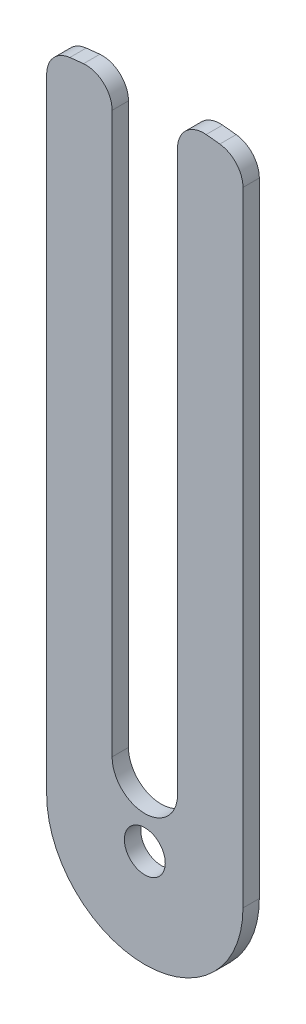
from build123d import *

# Parameters (mm, degrees)
BOSS_EXTRUDE1_DEPTH = 3.175
FILLET1_R           = 5.08


with BuildPart() as part:
    # Sketch1 → Boss-Extrude1 (new body)
    with BuildSketch(Plane.XY):
        with BuildLine():
            Line((-19.05, 125.563121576), (-19.05, 0))
            ThreePointArc((-19.05, 0), (-15.554259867, 10.998522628), (-6.35, 17.960512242))
            Line((-6.35, 17.960512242), (-6.35, 126.841150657))
            ThreePointArc((-6.35, 126.841150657), (-12.716066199, 126.361788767), (-19.05, 125.563121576))
        make_face()
        with BuildLine():
            Line((19.05, 0), (3.96875, 0))
            ThreePointArc((3.96875, 0), (0, -3.96875), (-3.96875, 0))
            Line((-3.96875, 0), (-19.05, 0))
            ThreePointArc((-19.05, 0), (0, -19.05), (19.05, 0))
        make_face()
        with BuildLine():
            ThreePointArc((-3.96875, 0), (0, 3.96875), (3.96875, 0))
            Line((3.96875, 0), (19.05, 0))
            ThreePointArc((19.05, 0), (15.554259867, 10.998522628), (6.35, 17.960512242))
            Line((6.35, 17.960512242), (6.35, 12.7))
            ThreePointArc((6.35, 12.7), (0, 6.35), (-6.35, 12.7))
            Line((-6.35, 12.7), (-6.35, 17.960512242))
            ThreePointArc((-6.35, 17.960512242), (-15.554259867, 10.998522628), (-19.05, 0))
            Line((-19.05, 0), (-3.96875, 0))
        make_face()
        with BuildLine():
            ThreePointArc((6.35, 17.960512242), (15.554259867, 10.998522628), (19.05, 0))
            Line((19.05, 0), (19.05, 125.563121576))
            ThreePointArc((19.05, 125.563121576), (12.716066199, 126.361788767), (6.35, 126.841150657))
            Line((6.35, 126.841150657), (6.35, 17.960512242))
        make_face()
    extrude(amount=BOSS_EXTRUDE1_DEPTH)

    # Fillet1
    fillet1_edges = [part.edges().sort_by_distance(p)[0] for p in [
        (6.35, 126.841150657, 1.5875),
        (19.05, 125.563121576, 1.5875),
        (-19.05, 125.563121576, 1.5875),
        (-6.35, 126.841150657, 1.5875),
    ]]
    fillet(fillet1_edges, radius=FILLET1_R)


solid = part.part
